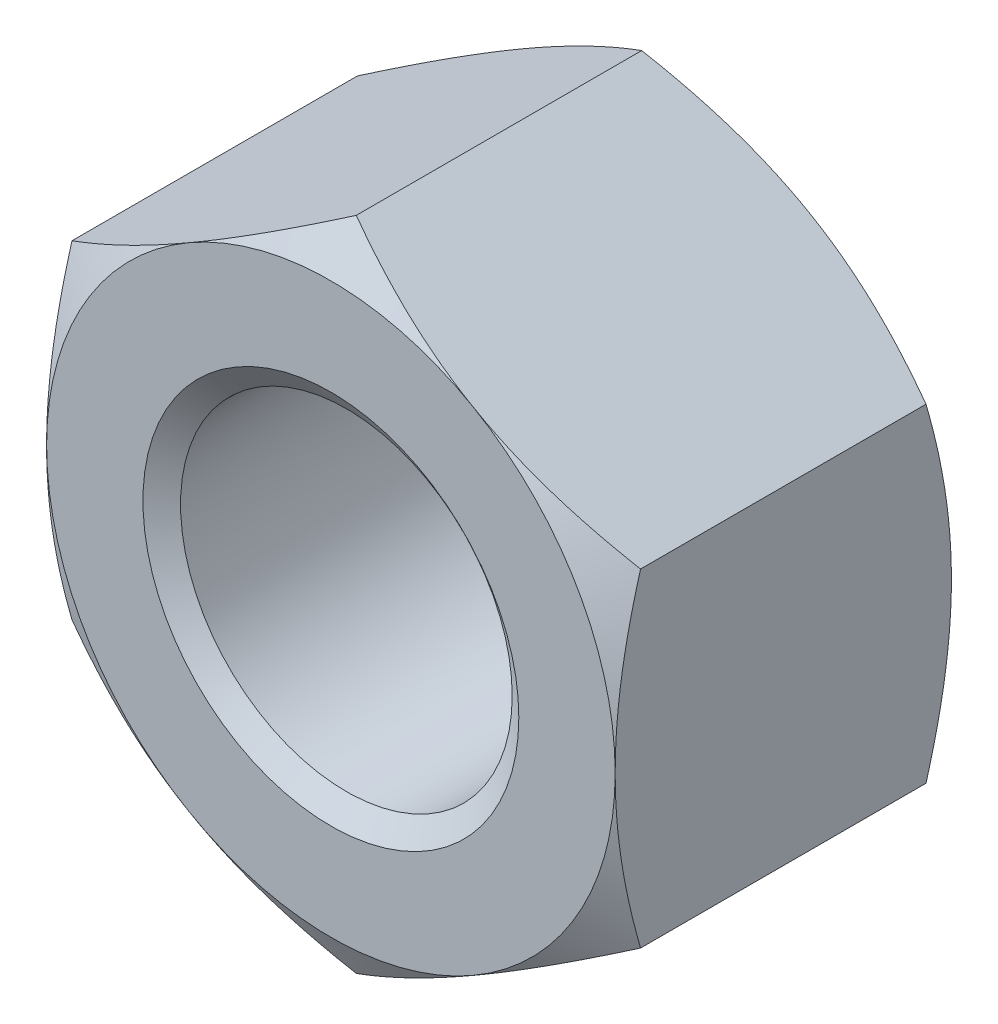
from build123d import *
from OCP.BRepFilletAPI import BRepFilletAPI_MakeChamfer

# Parameters (mm, degrees)
BASENUTSKE_R   = 11.1125
BASENUT_DEPTH  = 22.5298
CHAMFER1_SIZE  = 1.481666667
CHAMFER1_SIZE2 = 1.037474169


with BuildPart() as part:
    # BaseNutSke → BaseNut (new body)
    with BuildSketch(Plane.XY):
        Polygon((19.05, 10.998522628), (19.05, -10.998522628), (0, -21.997045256), (-19.05, -10.998522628), (-19.05, 10.998522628), (0, 21.997045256), align=None)
        Circle(BASENUTSKE_R, mode=Mode.SUBTRACT)
    extrude(amount=-BASENUT_DEPTH)

    # Sketch3 → Double-Chamfer (revolve, cut)
    with BuildSketch(Plane(origin=(0, 0, 0), x_dir=(0, 0, -1), z_dir=(1, 0, 0))):
        Polygon((22.5298, 19.05), (20.828322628, 21.997045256), (20.828322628, 31.997045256), (32.5298, 31.997045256), (32.5298, 19.05), align=None)
        Polygon((1.701477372, 31.997045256), (-10, 31.997045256), (-10, 19.05), (0, 19.05), (1.701477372, 21.997045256), align=None)
    revolve(axis=Axis((0, 0, 0), (0, 0, -1)), mode=Mode.SUBTRACT)

    # Chamfer1: one chamfer whose edges measure the first distance from different faces: ONE call of the kernel's chamfer builder (chamfer() names one face for all edges)
    chamfer1_edges_1 = [part.edges().sort_by_distance(p)[0] for p in [
        (-11.1125, 0, -22.5298),
    ]]
    chamfer1_side_1 = [part.faces().sort_by_distance(p)[0] for p in [
        (16.03115614, 9.255592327, -22.5298),
    ]]
    chamfer1_edges_2 = [part.edges().sort_by_distance(p)[0] for p in [
        (-11.1125, 0, 0),
    ]]
    chamfer1_side_2 = [part.faces().sort_by_distance(p)[0] for p in [
        (16.03115614, 9.255592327, 0),
    ]]
    chamfer1 = BRepFilletAPI_MakeChamfer(part.part.solid().wrapped)
    for e in chamfer1_edges_1:
        chamfer1.Add(CHAMFER1_SIZE, CHAMFER1_SIZE2, e.wrapped, chamfer1_side_1[0].wrapped)  # the first distance lies on this face
    for e in chamfer1_edges_2:
        chamfer1.Add(CHAMFER1_SIZE, CHAMFER1_SIZE2, e.wrapped, chamfer1_side_2[0].wrapped)  # the first distance lies on this face
    add(Compound.cast(chamfer1.Shape()), mode=Mode.REPLACE)


solid = part.part
